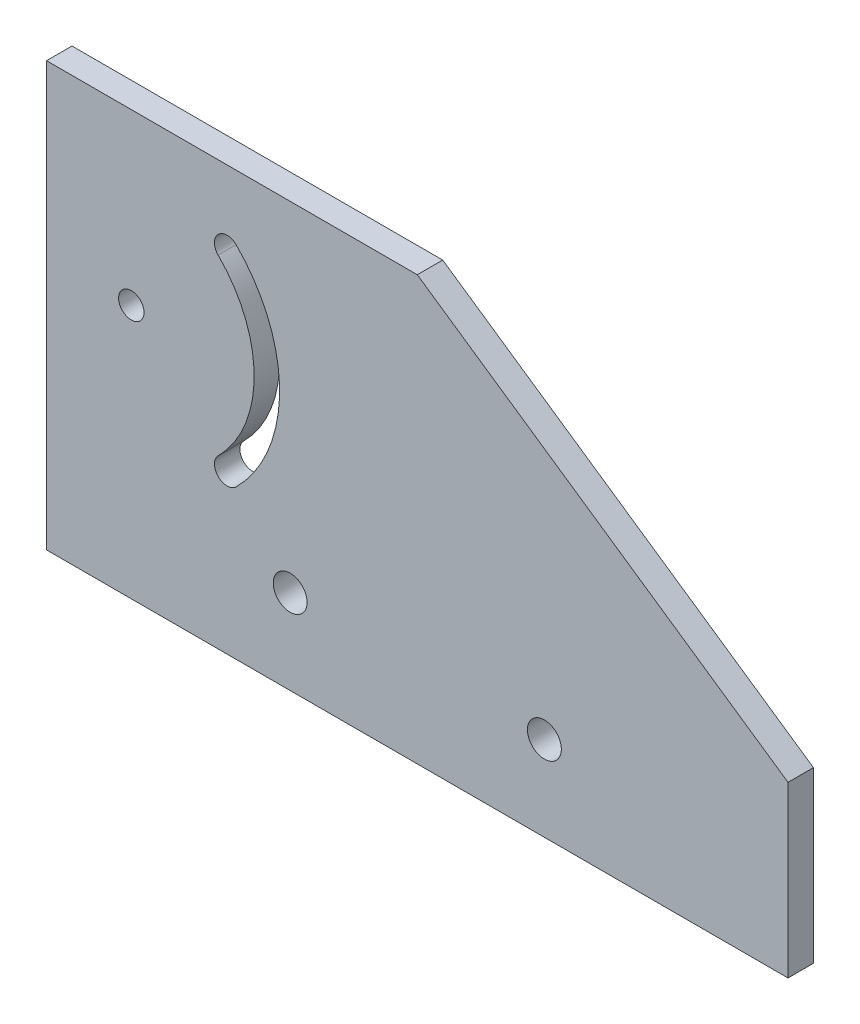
from build123d import *

# Parameters (mm, degrees)
SKETCH_1_W            = 87.5
SKETCH_1_H            = 50
EXTRUDE_1_DEPTH       = 3
HOLE_WIZARD_4_0_4_1_D = 4
CUT_EXTRUDE_2_DEPTH   = 10
SKETCH_6_R            = 1.5
CUT_EXTRUDE_3_DEPTH   = 24


with BuildPart() as part:
    # Sketch 1 → Extrude 1 (new body)
    with BuildSketch(Plane.XY):
        Rectangle(SKETCH_1_W, SKETCH_1_H)
    extrude(amount=EXTRUDE_1_DEPTH)

    # Hole Wizard 4.0 _4_ _1 (through all)
    with Locations(Plane.XY.offset(3)):
        with Locations((-15, -15), (15, -15)):
            Hole(HOLE_WIZARD_4_0_4_1_D / 2)

    # Sketch 5 → Cut-Extrude 2 (cut)
    with BuildSketch(Plane.XY.offset(3)):
        Polygon((0, 25), (43.75, 25), (43.75, -5), align=None)
    extrude(amount=-CUT_EXTRUDE_2_DEPTH, mode=Mode.SUBTRACT)

    # Sketch 6 → Cut-Extrude 3 (cut)
    with BuildSketch(Plane.XY.offset(3)):
        with Locations((-33.75, 5)):
            Circle(SKETCH_6_R)
        with BuildLine():
            ThreePointArc((-21.375631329, -7.374368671), (-16.25, 5), (-21.375631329, 17.374368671))
            ThreePointArc((-21.375631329, 17.374368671), (-23.496951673, 17.374368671), (-23.496951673, 15.253048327))
            ThreePointArc((-23.496951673, 15.253048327), (-19.25, 5), (-23.496951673, -5.253048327))
            ThreePointArc((-23.496951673, -5.253048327), (-23.496951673, -7.374368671), (-21.375631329, -7.374368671))
        make_face()
    extrude(amount=-CUT_EXTRUDE_3_DEPTH, mode=Mode.SUBTRACT)


solid = part.part
